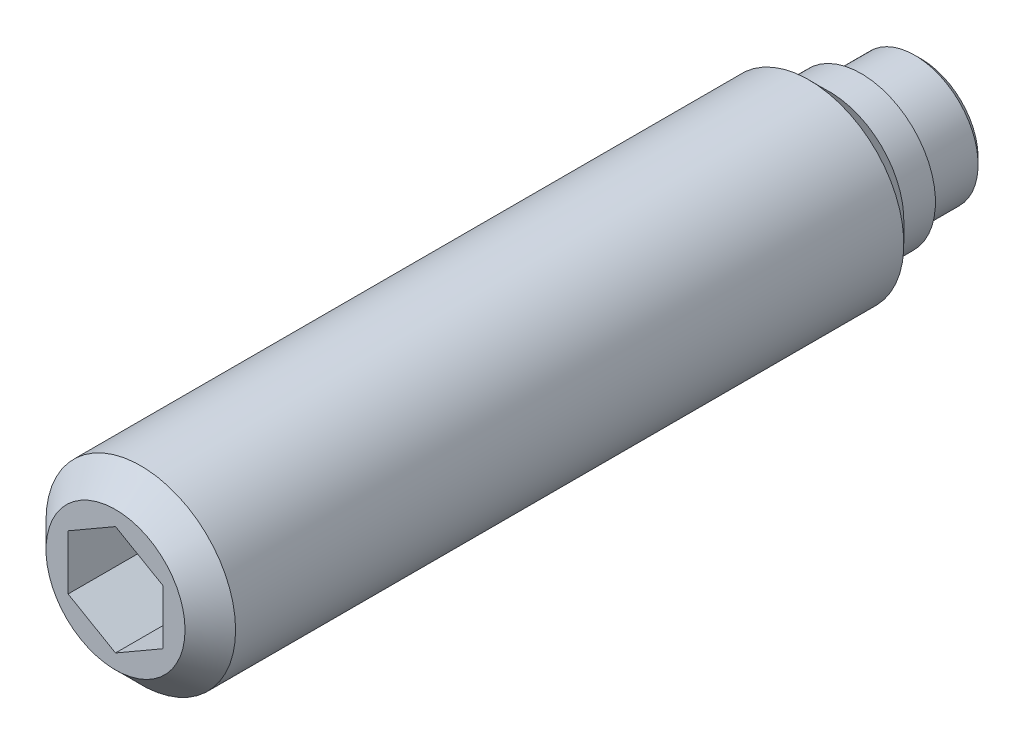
ISO-10303-21;
HEADER;
FILE_DESCRIPTION(('STEP AP214'),'2;1');
FILE_NAME('part.step','',(''),(''),'','','');
FILE_SCHEMA(('AUTOMOTIVE_DESIGN { 1 0 10303 214 1 1 1 1 }'));
ENDSEC;
DATA;
#1=APPLICATION_CONTEXT('core data for automotive mechanical design processes');
#2=APPLICATION_PROTOCOL_DEFINITION('international standard','automotive_design',2000,#1);
#3=PRODUCT_CONTEXT('',#1,'mechanical');
#4=PRODUCT('Part','Part','',(#3));
#5=PRODUCT_RELATED_PRODUCT_CATEGORY('part','',(#4));
#6=PRODUCT_DEFINITION_FORMATION('','',#4);
#7=PRODUCT_DEFINITION_CONTEXT('part definition',#1,'design');
#8=PRODUCT_DEFINITION('design','',#6,#7);
#9=PRODUCT_DEFINITION_SHAPE('','',#8);
#10=(LENGTH_UNIT() NAMED_UNIT(*) SI_UNIT(.MILLI.,.METRE.));
#11=(NAMED_UNIT(*) PLANE_ANGLE_UNIT() SI_UNIT($,.RADIAN.));
#12=(NAMED_UNIT(*) SI_UNIT($,.STERADIAN.) SOLID_ANGLE_UNIT());
#13=UNCERTAINTY_MEASURE_WITH_UNIT(LENGTH_MEASURE(1.E-05),#10,'distance_accuracy_value','');
#14=(GEOMETRIC_REPRESENTATION_CONTEXT(3) GLOBAL_UNCERTAINTY_ASSIGNED_CONTEXT((#13)) GLOBAL_UNIT_ASSIGNED_CONTEXT((#10,
#11,#12)) REPRESENTATION_CONTEXT('',''));
#15=CARTESIAN_POINT('',(0.,0.,0.));
#16=DIRECTION('',(0.,0.,1.));
#17=DIRECTION('',(1.,0.,0.));
#18=AXIS2_PLACEMENT_3D('',#15,#16,#17);
#19=CARTESIAN_POINT('',(0.,0.,1.9));
#20=DIRECTION('',(0.,0.,-1.));
#21=DIRECTION('',(-1.,0.,0.));
#22=AXIS2_PLACEMENT_3D('',#19,#20,#21);
#23=CYLINDRICAL_SURFACE('',#22,3.);
#24=CARTESIAN_POINT('',(0.,0.,24.7));
#25=DIRECTION('',(0.,0.,1.));
#26=DIRECTION('',(1.,0.,0.));
#27=AXIS2_PLACEMENT_3D('',#24,#25,#26);
#28=CIRCLE('',#27,3.);
#29=CARTESIAN_POINT('',(3.,0.,24.7));
#30=VERTEX_POINT('',#29);
#31=EDGE_CURVE('E9',#30,#30,#28,.F.);
#32=ORIENTED_EDGE('',*,*,#31,.T.);
#33=EDGE_LOOP('',(#32));
#34=FACE_BOUND('',#33,.T.);
#35=CARTESIAN_POINT('',(0.,0.,3.55));
#36=DIRECTION('',(0.,0.,-1.));
#37=DIRECTION('',(-1.,0.,0.));
#38=AXIS2_PLACEMENT_3D('',#35,#36,#37);
#39=CIRCLE('',#38,3.);
#40=CARTESIAN_POINT('',(-3.,0.,3.55));
#41=VERTEX_POINT('',#40);
#42=EDGE_CURVE('E74',#41,#41,#39,.T.);
#43=ORIENTED_EDGE('',*,*,#42,.F.);
#44=EDGE_LOOP('',(#43));
#45=FACE_BOUND('',#44,.T.);
#46=ADVANCED_FACE('F14',(#34,#45),#23,.T.);
#47=CARTESIAN_POINT('',(0.,0.,3.55));
#48=DIRECTION('',(0.,0.,1.));
#49=DIRECTION('',(1.,0.,0.));
#50=AXIS2_PLACEMENT_3D('',#47,#48,#49);
#51=CONICAL_SURFACE('',#50,3.,0.785398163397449);
#52=ORIENTED_EDGE('',*,*,#42,.T.);
#53=EDGE_LOOP('',(#52));
#54=FACE_BOUND('',#53,.T.);
#55=CARTESIAN_POINT('',(0.,0.,2.9));
#56=DIRECTION('',(0.,0.,-1.));
#57=DIRECTION('',(-1.,0.,0.));
#58=AXIS2_PLACEMENT_3D('',#55,#56,#57);
#59=CIRCLE('',#58,2.35);
#60=CARTESIAN_POINT('',(-2.35,0.,2.9));
#61=VERTEX_POINT('',#60);
#62=EDGE_CURVE('E112',#61,#61,#59,.T.);
#63=ORIENTED_EDGE('',*,*,#62,.F.);
#64=EDGE_LOOP('',(#63));
#65=FACE_BOUND('',#64,.T.);
#66=ADVANCED_FACE('F130',(#54,#65),#51,.T.);
#67=CARTESIAN_POINT('',(0.,0.,1.9));
#68=DIRECTION('',(0.,0.,-1.));
#69=DIRECTION('',(-1.,0.,0.));
#70=AXIS2_PLACEMENT_3D('',#67,#68,#69);
#71=CYLINDRICAL_SURFACE('',#70,2.35);
#72=ORIENTED_EDGE('',*,*,#62,.T.);
#73=EDGE_LOOP('',(#72));
#74=FACE_BOUND('',#73,.T.);
#75=CARTESIAN_POINT('',(0.,0.,1.9));
#76=DIRECTION('',(0.,0.,-1.));
#77=DIRECTION('',(-1.,0.,0.));
#78=AXIS2_PLACEMENT_3D('',#75,#76,#77);
#79=CIRCLE('',#78,2.35);
#80=CARTESIAN_POINT('',(-2.35,0.,1.9));
#81=VERTEX_POINT('',#80);
#82=EDGE_CURVE('E109',#81,#81,#79,.T.);
#83=ORIENTED_EDGE('',*,*,#82,.F.);
#84=EDGE_LOOP('',(#83));
#85=FACE_BOUND('',#84,.T.);
#86=ADVANCED_FACE('F135',(#74,#85),#71,.T.);
#87=CARTESIAN_POINT('',(0.,2.35,1.9));
#88=DIRECTION('',(0.,0.,1.));
#89=DIRECTION('',(1.,0.,0.));
#90=AXIS2_PLACEMENT_3D('',#87,#88,#89);
#91=PLANE('',#90);
#92=ORIENTED_EDGE('',*,*,#82,.T.);
#93=EDGE_LOOP('',(#92));
#94=FACE_BOUND('',#93,.T.);
#95=CARTESIAN_POINT('',(0.,0.,1.9));
#96=DIRECTION('',(0.,0.,-1.));
#97=DIRECTION('',(-1.,0.,0.));
#98=AXIS2_PLACEMENT_3D('',#95,#96,#97);
#99=CIRCLE('',#98,2.);
#100=CARTESIAN_POINT('',(-2.,0.,1.9));
#101=VERTEX_POINT('',#100);
#102=EDGE_CURVE('E106',#101,#101,#99,.T.);
#103=ORIENTED_EDGE('',*,*,#102,.F.);
#104=EDGE_LOOP('',(#103));
#105=FACE_BOUND('',#104,.T.);
#106=ADVANCED_FACE('F142',(#94,#105),#91,.F.);
#107=CARTESIAN_POINT('',(0.,0.,0.));
#108=DIRECTION('',(0.,0.,-1.));
#109=DIRECTION('',(-1.,0.,0.));
#110=AXIS2_PLACEMENT_3D('',#107,#108,#109);
#111=CYLINDRICAL_SURFACE('',#110,2.);
#112=CARTESIAN_POINT('',(0.,0.,0.2));
#113=DIRECTION('',(0.,0.,-1.));
#114=DIRECTION('',(-1.,0.,0.));
#115=AXIS2_PLACEMENT_3D('',#112,#113,#114);
#116=CIRCLE('',#115,2.);
#117=CARTESIAN_POINT('',(-2.,0.,0.2));
#118=VERTEX_POINT('',#117);
#119=EDGE_CURVE('E103',#118,#118,#116,.T.);
#120=ORIENTED_EDGE('',*,*,#119,.F.);
#121=EDGE_LOOP('',(#120));
#122=FACE_BOUND('',#121,.T.);
#123=ORIENTED_EDGE('',*,*,#102,.T.);
#124=EDGE_LOOP('',(#123));
#125=FACE_BOUND('',#124,.T.);
#126=ADVANCED_FACE('F146',(#122,#125),#111,.T.);
#127=CARTESIAN_POINT('',(0.,0.,0.2));
#128=DIRECTION('',(0.,0.,1.));
#129=DIRECTION('',(1.,0.,0.));
#130=AXIS2_PLACEMENT_3D('',#127,#128,#129);
#131=CONICAL_SURFACE('',#130,2.,0.785398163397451);
#132=CARTESIAN_POINT('',(0.,0.,0.));
#133=DIRECTION('',(0.,0.,-1.));
#134=DIRECTION('',(-1.,0.,0.));
#135=AXIS2_PLACEMENT_3D('',#132,#133,#134);
#136=CIRCLE('',#135,1.8);
#137=CARTESIAN_POINT('',(-1.8,0.,0.));
#138=VERTEX_POINT('',#137);
#139=EDGE_CURVE('E100',#138,#138,#136,.T.);
#140=ORIENTED_EDGE('',*,*,#139,.F.);
#141=EDGE_LOOP('',(#140));
#142=FACE_BOUND('',#141,.T.);
#143=ORIENTED_EDGE('',*,*,#119,.T.);
#144=EDGE_LOOP('',(#143));
#145=FACE_BOUND('',#144,.T.);
#146=ADVANCED_FACE('F150',(#142,#145),#131,.T.);
#147=CARTESIAN_POINT('',(0.,1.8,0.));
#148=DIRECTION('',(0.,0.,1.));
#149=DIRECTION('',(1.,0.,0.));
#150=AXIS2_PLACEMENT_3D('',#147,#148,#149);
#151=PLANE('',#150);
#152=ORIENTED_EDGE('',*,*,#139,.T.);
#153=EDGE_LOOP('',(#152));
#154=FACE_BOUND('',#153,.T.);
#155=ADVANCED_FACE('F154',(#154),#151,.F.);
#156=CARTESIAN_POINT('',(0.,0.,25.5));
#157=DIRECTION('',(0.,0.,1.));
#158=DIRECTION('',(1.,0.,0.));
#159=AXIS2_PLACEMENT_3D('',#156,#157,#158);
#160=PLANE('',#159);
#161=CARTESIAN_POINT('',(0.,0.,25.5));
#162=DIRECTION('',(0.,0.,1.));
#163=DIRECTION('',(1.,0.,0.));
#164=AXIS2_PLACEMENT_3D('',#161,#162,#163);
#165=CIRCLE('',#164,2.2);
#166=CARTESIAN_POINT('',(2.2,0.,25.5));
#167=VERTEX_POINT('',#166);
#168=EDGE_CURVE('E22',#167,#167,#165,.T.);
#169=ORIENTED_EDGE('',*,*,#168,.T.);
#170=EDGE_LOOP('',(#169));
#171=FACE_BOUND('',#170,.T.);
#172=DIRECTION('',(-0.866025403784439,0.5,0.));
#173=VECTOR('',#172,1.);
#174=CARTESIAN_POINT('',(-1.5,-0.866025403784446,25.5));
#175=LINE('',#174,#173);
#176=CARTESIAN_POINT('',(0.,-1.73205080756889,25.5));
#177=VERTEX_POINT('',#176);
#178=CARTESIAN_POINT('',(-1.5,-0.866025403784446,25.5));
#179=VERTEX_POINT('',#178);
#180=EDGE_CURVE('E69',#177,#179,#175,.T.);
#181=ORIENTED_EDGE('',*,*,#180,.T.);
#182=DIRECTION('',(0.,1.,0.));
#183=VECTOR('',#182,1.);
#184=CARTESIAN_POINT('',(-1.5,0.866025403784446,25.5));
#185=LINE('',#184,#183);
#186=CARTESIAN_POINT('',(-1.5,0.866025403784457,25.5));
#187=VERTEX_POINT('',#186);
#188=EDGE_CURVE('E84',#179,#187,#185,.T.);
#189=ORIENTED_EDGE('',*,*,#188,.T.);
#190=DIRECTION('',(0.866025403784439,0.5,0.));
#191=VECTOR('',#190,1.);
#192=CARTESIAN_POINT('',(0.,1.73205080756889,25.5));
#193=LINE('',#192,#191);
#194=CARTESIAN_POINT('',(0.,1.73205080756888,25.5));
#195=VERTEX_POINT('',#194);
#196=EDGE_CURVE('E301',#187,#195,#193,.T.);
#197=ORIENTED_EDGE('',*,*,#196,.T.);
#198=DIRECTION('',(0.866025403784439,-0.5,0.));
#199=VECTOR('',#198,1.);
#200=CARTESIAN_POINT('',(1.5,0.866025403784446,25.5));
#201=LINE('',#200,#199);
#202=CARTESIAN_POINT('',(1.5,0.866025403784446,25.5));
#203=VERTEX_POINT('',#202);
#204=EDGE_CURVE('E298',#195,#203,#201,.T.);
#205=ORIENTED_EDGE('',*,*,#204,.T.);
#206=DIRECTION('',(0.,-1.,0.));
#207=VECTOR('',#206,1.);
#208=CARTESIAN_POINT('',(1.5,-0.866025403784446,25.5));
#209=LINE('',#208,#207);
#210=CARTESIAN_POINT('',(1.5,-0.866025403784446,25.5));
#211=VERTEX_POINT('',#210);
#212=EDGE_CURVE('E29',#203,#211,#209,.T.);
#213=ORIENTED_EDGE('',*,*,#212,.T.);
#214=DIRECTION('',(-0.866025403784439,-0.5,0.));
#215=VECTOR('',#214,1.);
#216=CARTESIAN_POINT('',(0.,-1.73205080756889,25.5));
#217=LINE('',#216,#215);
#218=EDGE_CURVE('E66',#211,#177,#217,.T.);
#219=ORIENTED_EDGE('',*,*,#218,.T.);
#220=EDGE_LOOP('',(#181,#189,#197,#205,#213,#219));
#221=FACE_BOUND('',#220,.T.);
#222=ADVANCED_FACE('F68',(#171,#221),#160,.T.);
#223=CARTESIAN_POINT('',(0.,0.,22.));
#224=DIRECTION('',(0.,0.,1.));
#225=DIRECTION('',(1.,0.,0.));
#226=AXIS2_PLACEMENT_3D('',#223,#224,#225);
#227=PLANE('',#226);
#228=DIRECTION('',(0.,-1.,0.));
#229=VECTOR('',#228,1.);
#230=CARTESIAN_POINT('',(-1.5,0.866025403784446,22.));
#231=LINE('',#230,#229);
#232=CARTESIAN_POINT('',(-1.5,0.866025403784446,22.));
#233=VERTEX_POINT('',#232);
#234=CARTESIAN_POINT('',(-1.5,-0.866025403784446,22.));
#235=VERTEX_POINT('',#234);
#236=EDGE_CURVE('E83',#233,#235,#231,.T.);
#237=ORIENTED_EDGE('',*,*,#236,.T.);
#238=DIRECTION('',(0.866025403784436,-0.5,0.));
#239=VECTOR('',#238,1.);
#240=CARTESIAN_POINT('',(-1.5,-0.866025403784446,22.));
#241=LINE('',#240,#239);
#242=CARTESIAN_POINT('',(0.,-1.73205080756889,22.));
#243=VERTEX_POINT('',#242);
#244=EDGE_CURVE('E280',#235,#243,#241,.T.);
#245=ORIENTED_EDGE('',*,*,#244,.T.);
#246=DIRECTION('',(0.866025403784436,0.5,0.));
#247=VECTOR('',#246,1.);
#248=CARTESIAN_POINT('',(0.,-1.73205080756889,22.));
#249=LINE('',#248,#247);
#250=CARTESIAN_POINT('',(1.5,-0.866025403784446,22.));
#251=VERTEX_POINT('',#250);
#252=EDGE_CURVE('E88',#243,#251,#249,.T.);
#253=ORIENTED_EDGE('',*,*,#252,.T.);
#254=DIRECTION('',(0.,1.,0.));
#255=VECTOR('',#254,1.);
#256=CARTESIAN_POINT('',(1.5,-0.866025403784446,22.));
#257=LINE('',#256,#255);
#258=CARTESIAN_POINT('',(1.5,0.866025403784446,22.));
#259=VERTEX_POINT('',#258);
#260=EDGE_CURVE('E287',#251,#259,#257,.T.);
#261=ORIENTED_EDGE('',*,*,#260,.T.);
#262=DIRECTION('',(-0.866025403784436,0.5,0.));
#263=VECTOR('',#262,1.);
#264=CARTESIAN_POINT('',(1.5,0.866025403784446,22.));
#265=LINE('',#264,#263);
#266=CARTESIAN_POINT('',(0.,1.73205080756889,22.));
#267=VERTEX_POINT('',#266);
#268=EDGE_CURVE('E96',#259,#267,#265,.T.);
#269=ORIENTED_EDGE('',*,*,#268,.T.);
#270=DIRECTION('',(-0.866025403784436,-0.5,0.));
#271=VECTOR('',#270,1.);
#272=CARTESIAN_POINT('',(0.,1.73205080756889,22.));
#273=LINE('',#272,#271);
#274=EDGE_CURVE('E91',#267,#233,#273,.T.);
#275=ORIENTED_EDGE('',*,*,#274,.T.);
#276=EDGE_LOOP('',(#237,#245,#253,#261,#269,#275));
#277=FACE_BOUND('',#276,.T.);
#278=ADVANCED_FACE('F162',(#277),#227,.T.);
#279=CARTESIAN_POINT('',(0.,-1.73205080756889,38.));
#280=DIRECTION('',(0.5,-0.866025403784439,0.));
#281=DIRECTION('',(0.866025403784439,0.5,0.));
#282=AXIS2_PLACEMENT_3D('',#279,#280,#281);
#283=PLANE('',#282);
#284=ORIENTED_EDGE('',*,*,#218,.F.);
#285=DIRECTION('',(0.,0.,1.));
#286=VECTOR('',#285,1.);
#287=CARTESIAN_POINT('',(1.5,-0.866025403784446,38.));
#288=LINE('',#287,#286);
#289=EDGE_CURVE('E90',#251,#211,#288,.T.);
#290=ORIENTED_EDGE('',*,*,#289,.F.);
#291=ORIENTED_EDGE('',*,*,#252,.F.);
#292=DIRECTION('',(0.,0.,1.));
#293=VECTOR('',#292,1.);
#294=CARTESIAN_POINT('',(0.,-1.73205080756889,38.));
#295=LINE('',#294,#293);
#296=EDGE_CURVE('E80',#243,#177,#295,.T.);
#297=ORIENTED_EDGE('',*,*,#296,.T.);
#298=EDGE_LOOP('',(#284,#290,#291,#297));
#299=FACE_BOUND('',#298,.T.);
#300=ADVANCED_FACE('F86',(#299),#283,.F.);
#301=CARTESIAN_POINT('',(1.5,-0.866025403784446,38.));
#302=DIRECTION('',(1.,0.,0.));
#303=DIRECTION('',(0.,0.,-1.));
#304=AXIS2_PLACEMENT_3D('',#301,#302,#303);
#305=PLANE('',#304);
#306=ORIENTED_EDGE('',*,*,#212,.F.);
#307=DIRECTION('',(0.,0.,1.));
#308=VECTOR('',#307,1.);
#309=CARTESIAN_POINT('',(1.5,0.866025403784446,38.));
#310=LINE('',#309,#308);
#311=EDGE_CURVE('E93',#259,#203,#310,.T.);
#312=ORIENTED_EDGE('',*,*,#311,.F.);
#313=ORIENTED_EDGE('',*,*,#260,.F.);
#314=ORIENTED_EDGE('',*,*,#289,.T.);
#315=EDGE_LOOP('',(#306,#312,#313,#314));
#316=FACE_BOUND('',#315,.T.);
#317=ADVANCED_FACE('F161',(#316),#305,.F.);
#318=CARTESIAN_POINT('',(1.5,0.866025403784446,38.));
#319=DIRECTION('',(0.5,0.866025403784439,0.));
#320=DIRECTION('',(-0.866025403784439,0.5,0.));
#321=AXIS2_PLACEMENT_3D('',#318,#319,#320);
#322=PLANE('',#321);
#323=ORIENTED_EDGE('',*,*,#204,.F.);
#324=DIRECTION('',(0.,0.,1.));
#325=VECTOR('',#324,1.);
#326=CARTESIAN_POINT('',(0.,1.73205080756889,38.));
#327=LINE('',#326,#325);
#328=EDGE_CURVE('E293',#267,#195,#327,.T.);
#329=ORIENTED_EDGE('',*,*,#328,.F.);
#330=ORIENTED_EDGE('',*,*,#268,.F.);
#331=ORIENTED_EDGE('',*,*,#311,.T.);
#332=EDGE_LOOP('',(#323,#329,#330,#331));
#333=FACE_BOUND('',#332,.T.);
#334=ADVANCED_FACE('F165',(#333),#322,.F.);
#335=CARTESIAN_POINT('',(0.,1.73205080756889,38.));
#336=DIRECTION('',(-0.5,0.866025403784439,0.));
#337=DIRECTION('',(-0.866025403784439,-0.5,0.));
#338=AXIS2_PLACEMENT_3D('',#335,#336,#337);
#339=PLANE('',#338);
#340=ORIENTED_EDGE('',*,*,#196,.F.);
#341=DIRECTION('',(0.,0.,1.));
#342=VECTOR('',#341,1.);
#343=CARTESIAN_POINT('',(-1.5,0.866025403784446,38.));
#344=LINE('',#343,#342);
#345=EDGE_CURVE('E37',#233,#187,#344,.T.);
#346=ORIENTED_EDGE('',*,*,#345,.F.);
#347=ORIENTED_EDGE('',*,*,#274,.F.);
#348=ORIENTED_EDGE('',*,*,#328,.T.);
#349=EDGE_LOOP('',(#340,#346,#347,#348));
#350=FACE_BOUND('',#349,.T.);
#351=ADVANCED_FACE('F169',(#350),#339,.F.);
#352=CARTESIAN_POINT('',(-1.5,0.866025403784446,38.));
#353=DIRECTION('',(-1.,0.,0.));
#354=DIRECTION('',(0.,0.,1.));
#355=AXIS2_PLACEMENT_3D('',#352,#353,#354);
#356=PLANE('',#355);
#357=ORIENTED_EDGE('',*,*,#188,.F.);
#358=DIRECTION('',(0.,0.,1.));
#359=VECTOR('',#358,1.);
#360=CARTESIAN_POINT('',(-1.5,-0.866025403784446,38.));
#361=LINE('',#360,#359);
#362=EDGE_CURVE('E82',#235,#179,#361,.T.);
#363=ORIENTED_EDGE('',*,*,#362,.F.);
#364=ORIENTED_EDGE('',*,*,#236,.F.);
#365=ORIENTED_EDGE('',*,*,#345,.T.);
#366=EDGE_LOOP('',(#357,#363,#364,#365));
#367=FACE_BOUND('',#366,.T.);
#368=ADVANCED_FACE('F126',(#367),#356,.F.);
#369=CARTESIAN_POINT('',(-1.5,-0.866025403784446,38.));
#370=DIRECTION('',(-0.5,-0.866025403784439,0.));
#371=DIRECTION('',(0.866025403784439,-0.5,0.));
#372=AXIS2_PLACEMENT_3D('',#369,#370,#371);
#373=PLANE('',#372);
#374=ORIENTED_EDGE('',*,*,#180,.F.);
#375=ORIENTED_EDGE('',*,*,#296,.F.);
#376=ORIENTED_EDGE('',*,*,#244,.F.);
#377=ORIENTED_EDGE('',*,*,#362,.T.);
#378=EDGE_LOOP('',(#374,#375,#376,#377));
#379=FACE_BOUND('',#378,.T.);
#380=ADVANCED_FACE('F78',(#379),#373,.F.);
#381=CARTESIAN_POINT('',(0.,0.,25.5));
#382=DIRECTION('',(0.,0.,-1.));
#383=DIRECTION('',(-1.,0.,0.));
#384=AXIS2_PLACEMENT_3D('',#381,#382,#383);
#385=CONICAL_SURFACE('',#384,2.2,0.785398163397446);
#386=ORIENTED_EDGE('',*,*,#31,.F.);
#387=EDGE_LOOP('',(#386));
#388=FACE_BOUND('',#387,.T.);
#389=ORIENTED_EDGE('',*,*,#168,.F.);
#390=EDGE_LOOP('',(#389));
#391=FACE_BOUND('',#390,.T.);
#392=ADVANCED_FACE('F16',(#388,#391),#385,.T.);
#393=CLOSED_SHELL('',(#46,#66,#86,#106,#126,#146,#155,#222,#278,#300,#317,#334,#351,#368,#380,#392));
#394=MANIFOLD_SOLID_BREP('B1',#393);
#395=ADVANCED_BREP_SHAPE_REPRESENTATION('',(#18,#394),#14);
#396=SHAPE_DEFINITION_REPRESENTATION(#9,#395);
ENDSEC;
END-ISO-10303-21;
